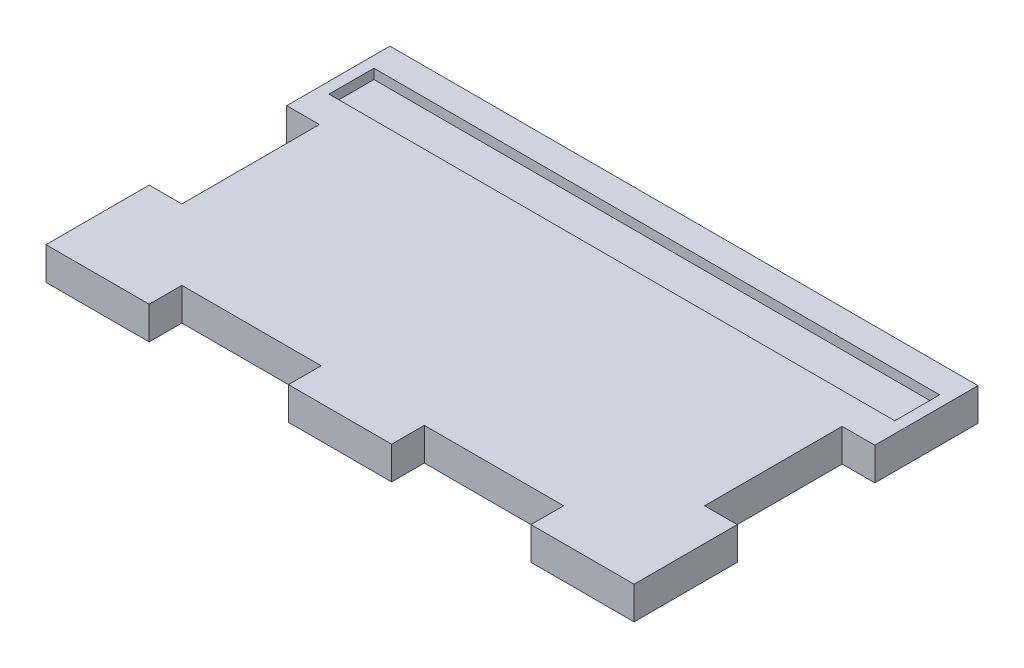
ISO-10303-21;
HEADER;
FILE_DESCRIPTION(('STEP AP214'),'2;1');
FILE_NAME('part.step','',(''),(''),'','','');
FILE_SCHEMA(('AUTOMOTIVE_DESIGN { 1 0 10303 214 1 1 1 1 }'));
ENDSEC;
DATA;
#1=APPLICATION_CONTEXT('core data for automotive mechanical design processes');
#2=APPLICATION_PROTOCOL_DEFINITION('international standard','automotive_design',2000,#1);
#3=PRODUCT_CONTEXT('',#1,'mechanical');
#4=PRODUCT('Part','Part','',(#3));
#5=PRODUCT_RELATED_PRODUCT_CATEGORY('part','',(#4));
#6=PRODUCT_DEFINITION_FORMATION('','',#4);
#7=PRODUCT_DEFINITION_CONTEXT('part definition',#1,'design');
#8=PRODUCT_DEFINITION('design','',#6,#7);
#9=PRODUCT_DEFINITION_SHAPE('','',#8);
#10=(LENGTH_UNIT() NAMED_UNIT(*) SI_UNIT(.MILLI.,.METRE.));
#11=(NAMED_UNIT(*) PLANE_ANGLE_UNIT() SI_UNIT($,.RADIAN.));
#12=(NAMED_UNIT(*) SI_UNIT($,.STERADIAN.) SOLID_ANGLE_UNIT());
#13=UNCERTAINTY_MEASURE_WITH_UNIT(LENGTH_MEASURE(1.E-05),#10,'distance_accuracy_value','');
#14=(GEOMETRIC_REPRESENTATION_CONTEXT(3) GLOBAL_UNCERTAINTY_ASSIGNED_CONTEXT((#13)) GLOBAL_UNIT_ASSIGNED_CONTEXT((#10,
#11,#12)) REPRESENTATION_CONTEXT('',''));
#15=CARTESIAN_POINT('',(0.,0.,0.));
#16=DIRECTION('',(0.,0.,1.));
#17=DIRECTION('',(1.,0.,0.));
#18=AXIS2_PLACEMENT_3D('',#15,#16,#17);
#19=CARTESIAN_POINT('',(-171.,19.,-100.));
#20=DIRECTION('',(1.,0.,0.));
#21=DIRECTION('',(0.,0.,-1.));
#22=AXIS2_PLACEMENT_3D('',#19,#20,#21);
#23=PLANE('',#22);
#24=DIRECTION('',(0.,1.,0.));
#25=VECTOR('',#24,1.);
#26=CARTESIAN_POINT('',(-171.,-0.001000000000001,-40.));
#27=LINE('',#26,#25);
#28=CARTESIAN_POINT('',(-171.,0.,-40.));
#29=VERTEX_POINT('',#28);
#30=CARTESIAN_POINT('',(-171.,19.,-40.));
#31=VERTEX_POINT('',#30);
#32=EDGE_CURVE('E252',#29,#31,#27,.T.);
#33=ORIENTED_EDGE('',*,*,#32,.T.);
#34=DIRECTION('',(0.,0.,1.));
#35=VECTOR('',#34,1.);
#36=CARTESIAN_POINT('',(-171.,19.,-100.));
#37=LINE('',#36,#35);
#38=CARTESIAN_POINT('',(-171.,19.,-100.));
#39=VERTEX_POINT('',#38);
#40=EDGE_CURVE('E344',#39,#31,#37,.T.);
#41=ORIENTED_EDGE('',*,*,#40,.F.);
#42=DIRECTION('',(0.,-1.,0.));
#43=VECTOR('',#42,1.);
#44=CARTESIAN_POINT('',(-171.,19.,-100.));
#45=LINE('',#44,#43);
#46=CARTESIAN_POINT('',(-171.,0.,-100.));
#47=VERTEX_POINT('',#46);
#48=EDGE_CURVE('E43',#39,#47,#45,.T.);
#49=ORIENTED_EDGE('',*,*,#48,.T.);
#50=DIRECTION('',(0.,0.,1.));
#51=VECTOR('',#50,1.);
#52=CARTESIAN_POINT('',(-171.,0.,-100.));
#53=LINE('',#52,#51);
#54=EDGE_CURVE('E359',#47,#29,#53,.T.);
#55=ORIENTED_EDGE('',*,*,#54,.T.);
#56=EDGE_LOOP('',(#33,#41,#49,#55));
#57=FACE_BOUND('',#56,.T.);
#58=ADVANCED_FACE('F35',(#57),#23,.F.);
#59=DIRECTION('',(0.,1.,0.));
#60=VECTOR('',#59,1.);
#61=CARTESIAN_POINT('',(-171.,-0.001000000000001,40.));
#62=LINE('',#61,#60);
#63=CARTESIAN_POINT('',(-171.,0.,40.));
#64=VERTEX_POINT('',#63);
#65=CARTESIAN_POINT('',(-171.,19.,40.));
#66=VERTEX_POINT('',#65);
#67=EDGE_CURVE('E251',#64,#66,#62,.T.);
#68=ORIENTED_EDGE('',*,*,#67,.F.);
#69=CARTESIAN_POINT('',(-171.,0.,100.));
#70=VERTEX_POINT('',#69);
#71=EDGE_CURVE('E358',#64,#70,#53,.T.);
#72=ORIENTED_EDGE('',*,*,#71,.T.);
#73=DIRECTION('',(0.,-1.,0.));
#74=VECTOR('',#73,1.);
#75=CARTESIAN_POINT('',(-171.,19.,100.));
#76=LINE('',#75,#74);
#77=CARTESIAN_POINT('',(-171.,19.,100.));
#78=VERTEX_POINT('',#77);
#79=EDGE_CURVE('E369',#78,#70,#76,.T.);
#80=ORIENTED_EDGE('',*,*,#79,.F.);
#81=EDGE_CURVE('E343',#66,#78,#37,.T.);
#82=ORIENTED_EDGE('',*,*,#81,.F.);
#83=EDGE_LOOP('',(#68,#72,#80,#82));
#84=FACE_BOUND('',#83,.T.);
#85=ADVANCED_FACE('F448',(#84),#23,.F.);
#86=CARTESIAN_POINT('',(-171.,19.,100.));
#87=DIRECTION('',(0.,0.,-1.));
#88=DIRECTION('',(-1.,0.,0.));
#89=AXIS2_PLACEMENT_3D('',#86,#87,#88);
#90=PLANE('',#89);
#91=DIRECTION('',(0.,1.,0.));
#92=VECTOR('',#91,1.);
#93=CARTESIAN_POINT('',(-111.,-0.001000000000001,100.));
#94=LINE('',#93,#92);
#95=CARTESIAN_POINT('',(-111.,0.,100.));
#96=VERTEX_POINT('',#95);
#97=CARTESIAN_POINT('',(-111.,19.,100.));
#98=VERTEX_POINT('',#97);
#99=EDGE_CURVE('E280',#96,#98,#94,.T.);
#100=ORIENTED_EDGE('',*,*,#99,.T.);
#101=DIRECTION('',(1.,0.,0.));
#102=VECTOR('',#101,1.);
#103=CARTESIAN_POINT('',(-171.,19.,100.));
#104=LINE('',#103,#102);
#105=EDGE_CURVE('E348',#78,#98,#104,.T.);
#106=ORIENTED_EDGE('',*,*,#105,.F.);
#107=ORIENTED_EDGE('',*,*,#79,.T.);
#108=DIRECTION('',(1.,0.,0.));
#109=VECTOR('',#108,1.);
#110=CARTESIAN_POINT('',(-171.,0.,100.));
#111=LINE('',#110,#109);
#112=EDGE_CURVE('E363',#70,#96,#111,.T.);
#113=ORIENTED_EDGE('',*,*,#112,.T.);
#114=EDGE_LOOP('',(#100,#106,#107,#113));
#115=FACE_BOUND('',#114,.T.);
#116=ADVANCED_FACE('F453',(#115),#90,.F.);
#117=DIRECTION('',(0.,1.,0.));
#118=VECTOR('',#117,1.);
#119=CARTESIAN_POINT('',(-30.,-0.001000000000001,100.));
#120=LINE('',#119,#118);
#121=CARTESIAN_POINT('',(-30.,0.,100.));
#122=VERTEX_POINT('',#121);
#123=CARTESIAN_POINT('',(-30.,19.,100.));
#124=VERTEX_POINT('',#123);
#125=EDGE_CURVE('E284',#122,#124,#120,.T.);
#126=ORIENTED_EDGE('',*,*,#125,.F.);
#127=CARTESIAN_POINT('',(30.,0.,100.));
#128=VERTEX_POINT('',#127);
#129=EDGE_CURVE('E366',#122,#128,#111,.T.);
#130=ORIENTED_EDGE('',*,*,#129,.T.);
#131=DIRECTION('',(0.,1.,0.));
#132=VECTOR('',#131,1.);
#133=CARTESIAN_POINT('',(30.,-0.001000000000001,100.));
#134=LINE('',#133,#132);
#135=CARTESIAN_POINT('',(30.,19.,100.));
#136=VERTEX_POINT('',#135);
#137=EDGE_CURVE('E329',#128,#136,#134,.T.);
#138=ORIENTED_EDGE('',*,*,#137,.T.);
#139=EDGE_CURVE('E352',#124,#136,#104,.T.);
#140=ORIENTED_EDGE('',*,*,#139,.F.);
#141=EDGE_LOOP('',(#126,#130,#138,#140));
#142=FACE_BOUND('',#141,.T.);
#143=ADVANCED_FACE('F423',(#142),#90,.F.);
#144=CARTESIAN_POINT('',(0.,19.,0.));
#145=DIRECTION('',(0.,1.,0.));
#146=DIRECTION('',(0.,0.,1.));
#147=AXIS2_PLACEMENT_3D('',#144,#145,#146);
#148=PLANE('',#147);
#149=DIRECTION('',(0.,0.,1.));
#150=VECTOR('',#149,1.);
#151=CARTESIAN_POINT('',(-164.5,19.,-84.2));
#152=LINE('',#151,#150);
#153=CARTESIAN_POINT('',(-164.5,19.,-84.2));
#154=VERTEX_POINT('',#153);
#155=CARTESIAN_POINT('',(-164.5,19.,-58.1));
#156=VERTEX_POINT('',#155);
#157=EDGE_CURVE('E50',#154,#156,#152,.T.);
#158=ORIENTED_EDGE('',*,*,#157,.F.);
#159=DIRECTION('',(-1.,0.,0.));
#160=VECTOR('',#159,1.);
#161=CARTESIAN_POINT('',(-164.5,19.,-84.2));
#162=LINE('',#161,#160);
#163=CARTESIAN_POINT('',(164.5,19.,-84.2));
#164=VERTEX_POINT('',#163);
#165=EDGE_CURVE('E216',#164,#154,#162,.T.);
#166=ORIENTED_EDGE('',*,*,#165,.F.);
#167=DIRECTION('',(0.,0.,-1.));
#168=VECTOR('',#167,1.);
#169=CARTESIAN_POINT('',(164.5,19.,-84.2));
#170=LINE('',#169,#168);
#171=CARTESIAN_POINT('',(164.5,19.,-58.1));
#172=VERTEX_POINT('',#171);
#173=EDGE_CURVE('E219',#172,#164,#170,.T.);
#174=ORIENTED_EDGE('',*,*,#173,.F.);
#175=DIRECTION('',(1.,0.,0.));
#176=VECTOR('',#175,1.);
#177=CARTESIAN_POINT('',(-164.5,19.,-58.1));
#178=LINE('',#177,#176);
#179=EDGE_CURVE('E225',#156,#172,#178,.T.);
#180=ORIENTED_EDGE('',*,*,#179,.F.);
#181=EDGE_LOOP('',(#158,#166,#174,#180));
#182=FACE_BOUND('',#181,.T.);
#183=ORIENTED_EDGE('',*,*,#40,.T.);
#184=DIRECTION('',(1.,0.,0.));
#185=VECTOR('',#184,1.);
#186=CARTESIAN_POINT('',(-171.,19.,-40.));
#187=LINE('',#186,#185);
#188=CARTESIAN_POINT('',(-152.,19.,-40.));
#189=VERTEX_POINT('',#188);
#190=EDGE_CURVE('E248',#31,#189,#187,.T.);
#191=ORIENTED_EDGE('',*,*,#190,.T.);
#192=DIRECTION('',(0.,0.,1.));
#193=VECTOR('',#192,1.);
#194=CARTESIAN_POINT('',(-152.,19.,-40.));
#195=LINE('',#194,#193);
#196=CARTESIAN_POINT('',(-152.,19.,40.));
#197=VERTEX_POINT('',#196);
#198=EDGE_CURVE('E245',#189,#197,#195,.T.);
#199=ORIENTED_EDGE('',*,*,#198,.T.);
#200=DIRECTION('',(-1.,0.,0.));
#201=VECTOR('',#200,1.);
#202=CARTESIAN_POINT('',(-171.,19.,40.));
#203=LINE('',#202,#201);
#204=EDGE_CURVE('E242',#197,#66,#203,.T.);
#205=ORIENTED_EDGE('',*,*,#204,.T.);
#206=ORIENTED_EDGE('',*,*,#81,.T.);
#207=ORIENTED_EDGE('',*,*,#105,.T.);
#208=DIRECTION('',(0.,0.,-1.));
#209=VECTOR('',#208,1.);
#210=CARTESIAN_POINT('',(-111.,19.,100.));
#211=LINE('',#210,#209);
#212=CARTESIAN_POINT('',(-111.,19.,81.));
#213=VERTEX_POINT('',#212);
#214=EDGE_CURVE('E271',#98,#213,#211,.T.);
#215=ORIENTED_EDGE('',*,*,#214,.T.);
#216=DIRECTION('',(1.,0.,0.));
#217=VECTOR('',#216,1.);
#218=CARTESIAN_POINT('',(-111.,19.,81.));
#219=LINE('',#218,#217);
#220=CARTESIAN_POINT('',(-30.,19.,81.));
#221=VERTEX_POINT('',#220);
#222=EDGE_CURVE('E277',#213,#221,#219,.T.);
#223=ORIENTED_EDGE('',*,*,#222,.T.);
#224=DIRECTION('',(0.,0.,1.));
#225=VECTOR('',#224,1.);
#226=CARTESIAN_POINT('',(-30.,19.,100.));
#227=LINE('',#226,#225);
#228=EDGE_CURVE('E274',#221,#124,#227,.T.);
#229=ORIENTED_EDGE('',*,*,#228,.T.);
#230=ORIENTED_EDGE('',*,*,#139,.T.);
#231=DIRECTION('',(0.,0.,1.));
#232=VECTOR('',#231,1.);
#233=CARTESIAN_POINT('',(30.,19.,100.));
#234=LINE('',#233,#232);
#235=CARTESIAN_POINT('',(30.,19.,81.));
#236=VERTEX_POINT('',#235);
#237=EDGE_CURVE('E323',#236,#136,#234,.T.);
#238=ORIENTED_EDGE('',*,*,#237,.F.);
#239=DIRECTION('',(-1.,0.,0.));
#240=VECTOR('',#239,1.);
#241=CARTESIAN_POINT('',(111.,19.,81.));
#242=LINE('',#241,#240);
#243=CARTESIAN_POINT('',(111.,19.,81.));
#244=VERTEX_POINT('',#243);
#245=EDGE_CURVE('E320',#244,#236,#242,.T.);
#246=ORIENTED_EDGE('',*,*,#245,.F.);
#247=DIRECTION('',(0.,0.,-1.));
#248=VECTOR('',#247,1.);
#249=CARTESIAN_POINT('',(111.,19.,100.));
#250=LINE('',#249,#248);
#251=CARTESIAN_POINT('',(111.,19.,100.));
#252=VERTEX_POINT('',#251);
#253=EDGE_CURVE('E317',#252,#244,#250,.T.);
#254=ORIENTED_EDGE('',*,*,#253,.F.);
#255=CARTESIAN_POINT('',(171.,19.,100.));
#256=VERTEX_POINT('',#255);
#257=EDGE_CURVE('E347',#252,#256,#104,.T.);
#258=ORIENTED_EDGE('',*,*,#257,.T.);
#259=DIRECTION('',(0.,0.,-1.));
#260=VECTOR('',#259,1.);
#261=CARTESIAN_POINT('',(171.,19.,-100.));
#262=LINE('',#261,#260);
#263=CARTESIAN_POINT('',(171.,19.,40.));
#264=VERTEX_POINT('',#263);
#265=EDGE_CURVE('E337',#256,#264,#262,.T.);
#266=ORIENTED_EDGE('',*,*,#265,.T.);
#267=DIRECTION('',(1.,0.,0.));
#268=VECTOR('',#267,1.);
#269=CARTESIAN_POINT('',(171.,19.,40.));
#270=LINE('',#269,#268);
#271=CARTESIAN_POINT('',(152.,19.,40.));
#272=VERTEX_POINT('',#271);
#273=EDGE_CURVE('E300',#272,#264,#270,.T.);
#274=ORIENTED_EDGE('',*,*,#273,.F.);
#275=DIRECTION('',(0.,0.,1.));
#276=VECTOR('',#275,1.);
#277=CARTESIAN_POINT('',(152.,19.,-40.));
#278=LINE('',#277,#276);
#279=CARTESIAN_POINT('',(152.,19.,-40.));
#280=VERTEX_POINT('',#279);
#281=EDGE_CURVE('E297',#280,#272,#278,.T.);
#282=ORIENTED_EDGE('',*,*,#281,.F.);
#283=DIRECTION('',(-1.,0.,0.));
#284=VECTOR('',#283,1.);
#285=CARTESIAN_POINT('',(171.,19.,-40.));
#286=LINE('',#285,#284);
#287=CARTESIAN_POINT('',(171.,19.,-40.));
#288=VERTEX_POINT('',#287);
#289=EDGE_CURVE('E294',#288,#280,#286,.T.);
#290=ORIENTED_EDGE('',*,*,#289,.F.);
#291=CARTESIAN_POINT('',(171.,19.,-100.));
#292=VERTEX_POINT('',#291);
#293=EDGE_CURVE('E341',#288,#292,#262,.T.);
#294=ORIENTED_EDGE('',*,*,#293,.T.);
#295=DIRECTION('',(-1.,0.,0.));
#296=VECTOR('',#295,1.);
#297=CARTESIAN_POINT('',(-171.,19.,-100.));
#298=LINE('',#297,#296);
#299=EDGE_CURVE('E340',#292,#39,#298,.T.);
#300=ORIENTED_EDGE('',*,*,#299,.T.);
#301=EDGE_LOOP('',(#183,#191,#199,#205,#206,#207,#215,#223,#229,#230,#238,#246,#254,#258,#266,
#274,#282,#290,#294,#300));
#302=FACE_BOUND('',#301,.T.);
#303=ADVANCED_FACE('F389',(#182,#302),#148,.T.);
#304=CARTESIAN_POINT('',(0.,0.,0.));
#305=DIRECTION('',(0.,1.,0.));
#306=DIRECTION('',(0.,0.,1.));
#307=AXIS2_PLACEMENT_3D('',#304,#305,#306);
#308=PLANE('',#307);
#309=DIRECTION('',(-1.,0.,0.));
#310=VECTOR('',#309,1.);
#311=CARTESIAN_POINT('',(-171.,0.,-40.));
#312=LINE('',#311,#310);
#313=CARTESIAN_POINT('',(-152.,0.,-40.));
#314=VERTEX_POINT('',#313);
#315=EDGE_CURVE('E238',#314,#29,#312,.T.);
#316=ORIENTED_EDGE('',*,*,#315,.T.);
#317=ORIENTED_EDGE('',*,*,#54,.F.);
#318=DIRECTION('',(-1.,0.,0.));
#319=VECTOR('',#318,1.);
#320=CARTESIAN_POINT('',(-171.,0.,-100.));
#321=LINE('',#320,#319);
#322=CARTESIAN_POINT('',(171.,0.,-100.));
#323=VERTEX_POINT('',#322);
#324=EDGE_CURVE('E356',#323,#47,#321,.T.);
#325=ORIENTED_EDGE('',*,*,#324,.F.);
#326=DIRECTION('',(0.,0.,-1.));
#327=VECTOR('',#326,1.);
#328=CARTESIAN_POINT('',(171.,0.,-100.));
#329=LINE('',#328,#327);
#330=CARTESIAN_POINT('',(171.,0.,-40.));
#331=VERTEX_POINT('',#330);
#332=EDGE_CURVE('E313',#331,#323,#329,.T.);
#333=ORIENTED_EDGE('',*,*,#332,.F.);
#334=DIRECTION('',(1.,0.,0.));
#335=VECTOR('',#334,1.);
#336=CARTESIAN_POINT('',(171.,0.,-40.));
#337=LINE('',#336,#335);
#338=CARTESIAN_POINT('',(152.,0.,-40.));
#339=VERTEX_POINT('',#338);
#340=EDGE_CURVE('E306',#339,#331,#337,.T.);
#341=ORIENTED_EDGE('',*,*,#340,.F.);
#342=DIRECTION('',(0.,0.,-1.));
#343=VECTOR('',#342,1.);
#344=CARTESIAN_POINT('',(152.,0.,-40.));
#345=LINE('',#344,#343);
#346=CARTESIAN_POINT('',(152.,0.,40.));
#347=VERTEX_POINT('',#346);
#348=EDGE_CURVE('E288',#347,#339,#345,.T.);
#349=ORIENTED_EDGE('',*,*,#348,.F.);
#350=DIRECTION('',(-1.,0.,0.));
#351=VECTOR('',#350,1.);
#352=CARTESIAN_POINT('',(171.,0.,40.));
#353=LINE('',#352,#351);
#354=CARTESIAN_POINT('',(171.,0.,40.));
#355=VERTEX_POINT('',#354);
#356=EDGE_CURVE('E290',#355,#347,#353,.T.);
#357=ORIENTED_EDGE('',*,*,#356,.F.);
#358=CARTESIAN_POINT('',(171.,0.,100.));
#359=VERTEX_POINT('',#358);
#360=EDGE_CURVE('E353',#359,#355,#329,.T.);
#361=ORIENTED_EDGE('',*,*,#360,.F.);
#362=CARTESIAN_POINT('',(111.,0.,100.));
#363=VERTEX_POINT('',#362);
#364=EDGE_CURVE('E362',#363,#359,#111,.T.);
#365=ORIENTED_EDGE('',*,*,#364,.F.);
#366=DIRECTION('',(0.,0.,1.));
#367=VECTOR('',#366,1.);
#368=CARTESIAN_POINT('',(111.,0.,100.));
#369=LINE('',#368,#367);
#370=CARTESIAN_POINT('',(111.,0.,81.));
#371=VERTEX_POINT('',#370);
#372=EDGE_CURVE('E315',#371,#363,#369,.T.);
#373=ORIENTED_EDGE('',*,*,#372,.F.);
#374=DIRECTION('',(1.,0.,0.));
#375=VECTOR('',#374,1.);
#376=CARTESIAN_POINT('',(111.,0.,81.));
#377=LINE('',#376,#375);
#378=CARTESIAN_POINT('',(30.,0.,81.));
#379=VERTEX_POINT('',#378);
#380=EDGE_CURVE('E291',#379,#371,#377,.T.);
#381=ORIENTED_EDGE('',*,*,#380,.F.);
#382=DIRECTION('',(0.,0.,-1.));
#383=VECTOR('',#382,1.);
#384=CARTESIAN_POINT('',(30.,0.,100.));
#385=LINE('',#384,#383);
#386=EDGE_CURVE('E262',#128,#379,#385,.T.);
#387=ORIENTED_EDGE('',*,*,#386,.F.);
#388=ORIENTED_EDGE('',*,*,#129,.F.);
#389=DIRECTION('',(0.,0.,-1.));
#390=VECTOR('',#389,1.);
#391=CARTESIAN_POINT('',(-30.,0.,100.));
#392=LINE('',#391,#390);
#393=CARTESIAN_POINT('',(-30.,0.,81.));
#394=VERTEX_POINT('',#393);
#395=EDGE_CURVE('E231',#122,#394,#392,.T.);
#396=ORIENTED_EDGE('',*,*,#395,.T.);
#397=DIRECTION('',(-1.,0.,0.));
#398=VECTOR('',#397,1.);
#399=CARTESIAN_POINT('',(-111.,0.,81.));
#400=LINE('',#399,#398);
#401=CARTESIAN_POINT('',(-111.,0.,81.));
#402=VERTEX_POINT('',#401);
#403=EDGE_CURVE('E265',#394,#402,#400,.T.);
#404=ORIENTED_EDGE('',*,*,#403,.T.);
#405=DIRECTION('',(0.,0.,1.));
#406=VECTOR('',#405,1.);
#407=CARTESIAN_POINT('',(-111.,0.,100.));
#408=LINE('',#407,#406);
#409=EDGE_CURVE('E268',#402,#96,#408,.T.);
#410=ORIENTED_EDGE('',*,*,#409,.T.);
#411=ORIENTED_EDGE('',*,*,#112,.F.);
#412=ORIENTED_EDGE('',*,*,#71,.F.);
#413=DIRECTION('',(1.,0.,0.));
#414=VECTOR('',#413,1.);
#415=CARTESIAN_POINT('',(-171.,0.,40.));
#416=LINE('',#415,#414);
#417=CARTESIAN_POINT('',(-152.,0.,40.));
#418=VERTEX_POINT('',#417);
#419=EDGE_CURVE('E255',#64,#418,#416,.T.);
#420=ORIENTED_EDGE('',*,*,#419,.T.);
#421=DIRECTION('',(0.,0.,-1.));
#422=VECTOR('',#421,1.);
#423=CARTESIAN_POINT('',(-152.,0.,-40.));
#424=LINE('',#423,#422);
#425=EDGE_CURVE('E235',#418,#314,#424,.T.);
#426=ORIENTED_EDGE('',*,*,#425,.T.);
#427=EDGE_LOOP('',(#316,#317,#325,#333,#341,#349,#357,#361,#365,#373,#381,#387,#388,#396,#404,
#410,#411,#412,#420,#426));
#428=FACE_BOUND('',#427,.T.);
#429=ADVANCED_FACE('F380',(#428),#308,.F.);
#430=CARTESIAN_POINT('',(171.,19.,-100.));
#431=DIRECTION('',(-1.,0.,0.));
#432=DIRECTION('',(0.,0.,1.));
#433=AXIS2_PLACEMENT_3D('',#430,#431,#432);
#434=PLANE('',#433);
#435=ORIENTED_EDGE('',*,*,#360,.T.);
#436=DIRECTION('',(0.,1.,0.));
#437=VECTOR('',#436,1.);
#438=CARTESIAN_POINT('',(171.,-0.001000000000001,40.));
#439=LINE('',#438,#437);
#440=EDGE_CURVE('E303',#355,#264,#439,.T.);
#441=ORIENTED_EDGE('',*,*,#440,.T.);
#442=ORIENTED_EDGE('',*,*,#265,.F.);
#443=DIRECTION('',(0.,-1.,0.));
#444=VECTOR('',#443,1.);
#445=CARTESIAN_POINT('',(171.,19.,100.));
#446=LINE('',#445,#444);
#447=EDGE_CURVE('E351',#256,#359,#446,.T.);
#448=ORIENTED_EDGE('',*,*,#447,.T.);
#449=EDGE_LOOP('',(#435,#441,#442,#448));
#450=FACE_BOUND('',#449,.T.);
#451=ADVANCED_FACE('F411',(#450),#434,.F.);
#452=ORIENTED_EDGE('',*,*,#257,.F.);
#453=DIRECTION('',(0.,1.,0.));
#454=VECTOR('',#453,1.);
#455=CARTESIAN_POINT('',(111.,-0.001000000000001,100.));
#456=LINE('',#455,#454);
#457=EDGE_CURVE('E327',#363,#252,#456,.T.);
#458=ORIENTED_EDGE('',*,*,#457,.F.);
#459=ORIENTED_EDGE('',*,*,#364,.T.);
#460=ORIENTED_EDGE('',*,*,#447,.F.);
#461=EDGE_LOOP('',(#452,#458,#459,#460));
#462=FACE_BOUND('',#461,.T.);
#463=ADVANCED_FACE('F416',(#462),#90,.F.);
#464=ORIENTED_EDGE('',*,*,#293,.F.);
#465=DIRECTION('',(0.,1.,0.));
#466=VECTOR('',#465,1.);
#467=CARTESIAN_POINT('',(171.,-0.001000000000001,-40.));
#468=LINE('',#467,#466);
#469=EDGE_CURVE('E302',#331,#288,#468,.T.);
#470=ORIENTED_EDGE('',*,*,#469,.F.);
#471=ORIENTED_EDGE('',*,*,#332,.T.);
#472=DIRECTION('',(0.,-1.,0.));
#473=VECTOR('',#472,1.);
#474=CARTESIAN_POINT('',(171.,19.,-100.));
#475=LINE('',#474,#473);
#476=EDGE_CURVE('E11',#292,#323,#475,.T.);
#477=ORIENTED_EDGE('',*,*,#476,.F.);
#478=EDGE_LOOP('',(#464,#470,#471,#477));
#479=FACE_BOUND('',#478,.T.);
#480=ADVANCED_FACE('F37',(#479),#434,.F.);
#481=CARTESIAN_POINT('',(-171.,19.,-100.));
#482=DIRECTION('',(0.,0.,1.));
#483=DIRECTION('',(1.,0.,0.));
#484=AXIS2_PLACEMENT_3D('',#481,#482,#483);
#485=PLANE('',#484);
#486=ORIENTED_EDGE('',*,*,#324,.T.);
#487=ORIENTED_EDGE('',*,*,#48,.F.);
#488=ORIENTED_EDGE('',*,*,#299,.F.);
#489=ORIENTED_EDGE('',*,*,#476,.T.);
#490=EDGE_LOOP('',(#486,#487,#488,#489));
#491=FACE_BOUND('',#490,.T.);
#492=ADVANCED_FACE('F393',(#491),#485,.F.);
#493=CARTESIAN_POINT('',(111.,-0.001000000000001,100.));
#494=DIRECTION('',(1.,0.,0.));
#495=DIRECTION('',(0.,0.,-1.));
#496=AXIS2_PLACEMENT_3D('',#493,#494,#495);
#497=PLANE('',#496);
#498=ORIENTED_EDGE('',*,*,#372,.T.);
#499=ORIENTED_EDGE('',*,*,#457,.T.);
#500=ORIENTED_EDGE('',*,*,#253,.T.);
#501=DIRECTION('',(0.,1.,0.));
#502=VECTOR('',#501,1.);
#503=CARTESIAN_POINT('',(111.,-0.001000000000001,81.));
#504=LINE('',#503,#502);
#505=EDGE_CURVE('E326',#371,#244,#504,.T.);
#506=ORIENTED_EDGE('',*,*,#505,.F.);
#507=EDGE_LOOP('',(#498,#499,#500,#506));
#508=FACE_BOUND('',#507,.T.);
#509=ADVANCED_FACE('F437',(#508),#497,.F.);
#510=CARTESIAN_POINT('',(30.,-0.001000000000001,100.));
#511=DIRECTION('',(-1.,0.,0.));
#512=DIRECTION('',(0.,0.,1.));
#513=AXIS2_PLACEMENT_3D('',#510,#511,#512);
#514=PLANE('',#513);
#515=ORIENTED_EDGE('',*,*,#386,.T.);
#516=DIRECTION('',(0.,1.,0.));
#517=VECTOR('',#516,1.);
#518=CARTESIAN_POINT('',(30.,-0.001000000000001,81.));
#519=LINE('',#518,#517);
#520=EDGE_CURVE('E332',#379,#236,#519,.T.);
#521=ORIENTED_EDGE('',*,*,#520,.T.);
#522=ORIENTED_EDGE('',*,*,#237,.T.);
#523=ORIENTED_EDGE('',*,*,#137,.F.);
#524=EDGE_LOOP('',(#515,#521,#522,#523));
#525=FACE_BOUND('',#524,.T.);
#526=ADVANCED_FACE('F427',(#525),#514,.F.);
#527=CARTESIAN_POINT('',(111.,-0.001000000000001,81.));
#528=DIRECTION('',(0.,0.,-1.));
#529=DIRECTION('',(-1.,0.,0.));
#530=AXIS2_PLACEMENT_3D('',#527,#528,#529);
#531=PLANE('',#530);
#532=ORIENTED_EDGE('',*,*,#380,.T.);
#533=ORIENTED_EDGE('',*,*,#505,.T.);
#534=ORIENTED_EDGE('',*,*,#245,.T.);
#535=ORIENTED_EDGE('',*,*,#520,.F.);
#536=EDGE_LOOP('',(#532,#533,#534,#535));
#537=FACE_BOUND('',#536,.T.);
#538=ADVANCED_FACE('F432',(#537),#531,.F.);
#539=CARTESIAN_POINT('',(171.,-0.001000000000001,40.));
#540=DIRECTION('',(0.,0.,1.));
#541=DIRECTION('',(1.,0.,0.));
#542=AXIS2_PLACEMENT_3D('',#539,#540,#541);
#543=PLANE('',#542);
#544=ORIENTED_EDGE('',*,*,#356,.T.);
#545=DIRECTION('',(0.,1.,0.));
#546=VECTOR('',#545,1.);
#547=CARTESIAN_POINT('',(152.,-0.001000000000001,40.));
#548=LINE('',#547,#546);
#549=EDGE_CURVE('E307',#347,#272,#548,.T.);
#550=ORIENTED_EDGE('',*,*,#549,.T.);
#551=ORIENTED_EDGE('',*,*,#273,.T.);
#552=ORIENTED_EDGE('',*,*,#440,.F.);
#553=EDGE_LOOP('',(#544,#550,#551,#552));
#554=FACE_BOUND('',#553,.T.);
#555=ADVANCED_FACE('F407',(#554),#543,.F.);
#556=CARTESIAN_POINT('',(152.,-0.001000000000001,-40.));
#557=DIRECTION('',(-1.,0.,0.));
#558=DIRECTION('',(0.,0.,1.));
#559=AXIS2_PLACEMENT_3D('',#556,#557,#558);
#560=PLANE('',#559);
#561=ORIENTED_EDGE('',*,*,#348,.T.);
#562=DIRECTION('',(0.,1.,0.));
#563=VECTOR('',#562,1.);
#564=CARTESIAN_POINT('',(152.,-0.001000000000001,-40.));
#565=LINE('',#564,#563);
#566=EDGE_CURVE('E309',#339,#280,#565,.T.);
#567=ORIENTED_EDGE('',*,*,#566,.T.);
#568=ORIENTED_EDGE('',*,*,#281,.T.);
#569=ORIENTED_EDGE('',*,*,#549,.F.);
#570=EDGE_LOOP('',(#561,#567,#568,#569));
#571=FACE_BOUND('',#570,.T.);
#572=ADVANCED_FACE('F404',(#571),#560,.F.);
#573=CARTESIAN_POINT('',(171.,-0.001000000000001,-40.));
#574=DIRECTION('',(0.,0.,-1.));
#575=DIRECTION('',(-1.,0.,0.));
#576=AXIS2_PLACEMENT_3D('',#573,#574,#575);
#577=PLANE('',#576);
#578=ORIENTED_EDGE('',*,*,#340,.T.);
#579=ORIENTED_EDGE('',*,*,#469,.T.);
#580=ORIENTED_EDGE('',*,*,#289,.T.);
#581=ORIENTED_EDGE('',*,*,#566,.F.);
#582=EDGE_LOOP('',(#578,#579,#580,#581));
#583=FACE_BOUND('',#582,.T.);
#584=ADVANCED_FACE('F401',(#583),#577,.F.);
#585=CARTESIAN_POINT('',(-111.,-0.001000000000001,100.));
#586=DIRECTION('',(1.,0.,0.));
#587=DIRECTION('',(0.,0.,-1.));
#588=AXIS2_PLACEMENT_3D('',#585,#586,#587);
#589=PLANE('',#588);
#590=DIRECTION('',(0.,1.,0.));
#591=VECTOR('',#590,1.);
#592=CARTESIAN_POINT('',(-111.,-0.001000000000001,81.));
#593=LINE('',#592,#591);
#594=EDGE_CURVE('E239',#402,#213,#593,.T.);
#595=ORIENTED_EDGE('',*,*,#594,.T.);
#596=ORIENTED_EDGE('',*,*,#214,.F.);
#597=ORIENTED_EDGE('',*,*,#99,.F.);
#598=ORIENTED_EDGE('',*,*,#409,.F.);
#599=EDGE_LOOP('',(#595,#596,#597,#598));
#600=FACE_BOUND('',#599,.T.);
#601=ADVANCED_FACE('F494',(#600),#589,.T.);
#602=CARTESIAN_POINT('',(-111.,-0.001000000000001,81.));
#603=DIRECTION('',(0.,0.,1.));
#604=DIRECTION('',(1.,0.,0.));
#605=AXIS2_PLACEMENT_3D('',#602,#603,#604);
#606=PLANE('',#605);
#607=DIRECTION('',(0.,1.,0.));
#608=VECTOR('',#607,1.);
#609=CARTESIAN_POINT('',(-30.,-0.001000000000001,81.));
#610=LINE('',#609,#608);
#611=EDGE_CURVE('E282',#394,#221,#610,.T.);
#612=ORIENTED_EDGE('',*,*,#611,.T.);
#613=ORIENTED_EDGE('',*,*,#222,.F.);
#614=ORIENTED_EDGE('',*,*,#594,.F.);
#615=ORIENTED_EDGE('',*,*,#403,.F.);
#616=EDGE_LOOP('',(#612,#613,#614,#615));
#617=FACE_BOUND('',#616,.T.);
#618=ADVANCED_FACE('F491',(#617),#606,.T.);
#619=CARTESIAN_POINT('',(-30.,-0.001000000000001,100.));
#620=DIRECTION('',(-1.,0.,0.));
#621=DIRECTION('',(0.,0.,1.));
#622=AXIS2_PLACEMENT_3D('',#619,#620,#621);
#623=PLANE('',#622);
#624=ORIENTED_EDGE('',*,*,#125,.T.);
#625=ORIENTED_EDGE('',*,*,#228,.F.);
#626=ORIENTED_EDGE('',*,*,#611,.F.);
#627=ORIENTED_EDGE('',*,*,#395,.F.);
#628=EDGE_LOOP('',(#624,#625,#626,#627));
#629=FACE_BOUND('',#628,.T.);
#630=ADVANCED_FACE('F486',(#629),#623,.T.);
#631=CARTESIAN_POINT('',(-171.,-0.001000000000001,-40.));
#632=DIRECTION('',(0.,0.,1.));
#633=DIRECTION('',(1.,0.,0.));
#634=AXIS2_PLACEMENT_3D('',#631,#632,#633);
#635=PLANE('',#634);
#636=DIRECTION('',(0.,1.,0.));
#637=VECTOR('',#636,1.);
#638=CARTESIAN_POINT('',(-152.,-0.001000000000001,-40.));
#639=LINE('',#638,#637);
#640=EDGE_CURVE('E256',#314,#189,#639,.T.);
#641=ORIENTED_EDGE('',*,*,#640,.T.);
#642=ORIENTED_EDGE('',*,*,#190,.F.);
#643=ORIENTED_EDGE('',*,*,#32,.F.);
#644=ORIENTED_EDGE('',*,*,#315,.F.);
#645=EDGE_LOOP('',(#641,#642,#643,#644));
#646=FACE_BOUND('',#645,.T.);
#647=ADVANCED_FACE('F384',(#646),#635,.T.);
#648=CARTESIAN_POINT('',(-152.,-0.001000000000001,-40.));
#649=DIRECTION('',(-1.,0.,0.));
#650=DIRECTION('',(0.,0.,1.));
#651=AXIS2_PLACEMENT_3D('',#648,#649,#650);
#652=PLANE('',#651);
#653=DIRECTION('',(0.,1.,0.));
#654=VECTOR('',#653,1.);
#655=CARTESIAN_POINT('',(-152.,-0.001000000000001,40.));
#656=LINE('',#655,#654);
#657=EDGE_CURVE('E58',#418,#197,#656,.T.);
#658=ORIENTED_EDGE('',*,*,#657,.T.);
#659=ORIENTED_EDGE('',*,*,#198,.F.);
#660=ORIENTED_EDGE('',*,*,#640,.F.);
#661=ORIENTED_EDGE('',*,*,#425,.F.);
#662=EDGE_LOOP('',(#658,#659,#660,#661));
#663=FACE_BOUND('',#662,.T.);
#664=ADVANCED_FACE('F387',(#663),#652,.T.);
#665=CARTESIAN_POINT('',(-171.,-0.001000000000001,40.));
#666=DIRECTION('',(0.,0.,-1.));
#667=DIRECTION('',(-1.,0.,0.));
#668=AXIS2_PLACEMENT_3D('',#665,#666,#667);
#669=PLANE('',#668);
#670=ORIENTED_EDGE('',*,*,#67,.T.);
#671=ORIENTED_EDGE('',*,*,#204,.F.);
#672=ORIENTED_EDGE('',*,*,#657,.F.);
#673=ORIENTED_EDGE('',*,*,#419,.F.);
#674=EDGE_LOOP('',(#670,#671,#672,#673));
#675=FACE_BOUND('',#674,.T.);
#676=ADVANCED_FACE('F478',(#675),#669,.T.);
#677=CARTESIAN_POINT('',(-164.5,13.3,-84.2));
#678=DIRECTION('',(-1.,0.,0.));
#679=DIRECTION('',(0.,0.,1.));
#680=AXIS2_PLACEMENT_3D('',#677,#678,#679);
#681=PLANE('',#680);
#682=ORIENTED_EDGE('',*,*,#157,.T.);
#683=DIRECTION('',(0.,1.,0.));
#684=VECTOR('',#683,1.);
#685=CARTESIAN_POINT('',(-164.5,13.3,-58.1));
#686=LINE('',#685,#684);
#687=CARTESIAN_POINT('',(-164.5,13.3,-58.1));
#688=VERTEX_POINT('',#687);
#689=EDGE_CURVE('E194',#688,#156,#686,.T.);
#690=ORIENTED_EDGE('',*,*,#689,.F.);
#691=DIRECTION('',(0.,0.,1.));
#692=VECTOR('',#691,1.);
#693=CARTESIAN_POINT('',(-164.5,13.3,-84.2));
#694=LINE('',#693,#692);
#695=CARTESIAN_POINT('',(-164.5,13.3,-84.2));
#696=VERTEX_POINT('',#695);
#697=EDGE_CURVE('E198',#696,#688,#694,.T.);
#698=ORIENTED_EDGE('',*,*,#697,.F.);
#699=DIRECTION('',(0.,1.,0.));
#700=VECTOR('',#699,1.);
#701=CARTESIAN_POINT('',(-164.5,13.3,-84.2));
#702=LINE('',#701,#700);
#703=EDGE_CURVE('E229',#696,#154,#702,.T.);
#704=ORIENTED_EDGE('',*,*,#703,.T.);
#705=EDGE_LOOP('',(#682,#690,#698,#704));
#706=FACE_BOUND('',#705,.T.);
#707=ADVANCED_FACE('F196',(#706),#681,.F.);
#708=CARTESIAN_POINT('',(-164.5,13.3,-84.2));
#709=DIRECTION('',(0.,0.,-1.));
#710=DIRECTION('',(-1.,0.,0.));
#711=AXIS2_PLACEMENT_3D('',#708,#709,#710);
#712=PLANE('',#711);
#713=ORIENTED_EDGE('',*,*,#165,.T.);
#714=ORIENTED_EDGE('',*,*,#703,.F.);
#715=DIRECTION('',(-1.,0.,0.));
#716=VECTOR('',#715,1.);
#717=CARTESIAN_POINT('',(-164.5,13.3,-84.2));
#718=LINE('',#717,#716);
#719=CARTESIAN_POINT('',(164.5,13.3,-84.2));
#720=VERTEX_POINT('',#719);
#721=EDGE_CURVE('E204',#720,#696,#718,.T.);
#722=ORIENTED_EDGE('',*,*,#721,.F.);
#723=DIRECTION('',(0.,1.,0.));
#724=VECTOR('',#723,1.);
#725=CARTESIAN_POINT('',(164.5,13.3,-84.2));
#726=LINE('',#725,#724);
#727=EDGE_CURVE('E232',#720,#164,#726,.T.);
#728=ORIENTED_EDGE('',*,*,#727,.T.);
#729=EDGE_LOOP('',(#713,#714,#722,#728));
#730=FACE_BOUND('',#729,.T.);
#731=ADVANCED_FACE('F470',(#730),#712,.F.);
#732=CARTESIAN_POINT('',(164.5,13.3,-84.2));
#733=DIRECTION('',(1.,0.,0.));
#734=DIRECTION('',(0.,0.,-1.));
#735=AXIS2_PLACEMENT_3D('',#732,#733,#734);
#736=PLANE('',#735);
#737=ORIENTED_EDGE('',*,*,#173,.T.);
#738=ORIENTED_EDGE('',*,*,#727,.F.);
#739=DIRECTION('',(0.,0.,-1.));
#740=VECTOR('',#739,1.);
#741=CARTESIAN_POINT('',(164.5,13.3,-84.2));
#742=LINE('',#741,#740);
#743=CARTESIAN_POINT('',(164.5,13.3,-58.1));
#744=VERTEX_POINT('',#743);
#745=EDGE_CURVE('E212',#744,#720,#742,.T.);
#746=ORIENTED_EDGE('',*,*,#745,.F.);
#747=DIRECTION('',(0.,1.,0.));
#748=VECTOR('',#747,1.);
#749=CARTESIAN_POINT('',(164.5,13.3,-58.1));
#750=LINE('',#749,#748);
#751=EDGE_CURVE('E203',#744,#172,#750,.T.);
#752=ORIENTED_EDGE('',*,*,#751,.T.);
#753=EDGE_LOOP('',(#737,#738,#746,#752));
#754=FACE_BOUND('',#753,.T.);
#755=ADVANCED_FACE('F468',(#754),#736,.F.);
#756=CARTESIAN_POINT('',(-164.5,13.3,-58.1));
#757=DIRECTION('',(0.,0.,1.));
#758=DIRECTION('',(1.,0.,0.));
#759=AXIS2_PLACEMENT_3D('',#756,#757,#758);
#760=PLANE('',#759);
#761=ORIENTED_EDGE('',*,*,#179,.T.);
#762=ORIENTED_EDGE('',*,*,#751,.F.);
#763=DIRECTION('',(1.,0.,0.));
#764=VECTOR('',#763,1.);
#765=CARTESIAN_POINT('',(-164.5,13.3,-58.1));
#766=LINE('',#765,#764);
#767=EDGE_CURVE('E207',#688,#744,#766,.T.);
#768=ORIENTED_EDGE('',*,*,#767,.F.);
#769=ORIENTED_EDGE('',*,*,#689,.T.);
#770=EDGE_LOOP('',(#761,#762,#768,#769));
#771=FACE_BOUND('',#770,.T.);
#772=ADVANCED_FACE('F208',(#771),#760,.F.);
#773=CARTESIAN_POINT('',(0.,13.3,0.));
#774=DIRECTION('',(0.,1.,0.));
#775=DIRECTION('',(0.,0.,1.));
#776=AXIS2_PLACEMENT_3D('',#773,#774,#775);
#777=PLANE('',#776);
#778=ORIENTED_EDGE('',*,*,#697,.T.);
#779=ORIENTED_EDGE('',*,*,#767,.T.);
#780=ORIENTED_EDGE('',*,*,#745,.T.);
#781=ORIENTED_EDGE('',*,*,#721,.T.);
#782=EDGE_LOOP('',(#778,#779,#780,#781));
#783=FACE_BOUND('',#782,.T.);
#784=ADVANCED_FACE('F214',(#783),#777,.T.);
#785=CLOSED_SHELL('',(#58,#85,#116,#143,#303,#429,#451,#463,#480,#492,#509,#526,#538,#555,#572,
#584,#601,#618,#630,#647,#664,#676,#707,#731,#755,#772,#784));
#786=MANIFOLD_SOLID_BREP('B2',#785);
#787=ADVANCED_BREP_SHAPE_REPRESENTATION('',(#18,#786),#14);
#788=SHAPE_DEFINITION_REPRESENTATION(#9,#787);
ENDSEC;
END-ISO-10303-21;
